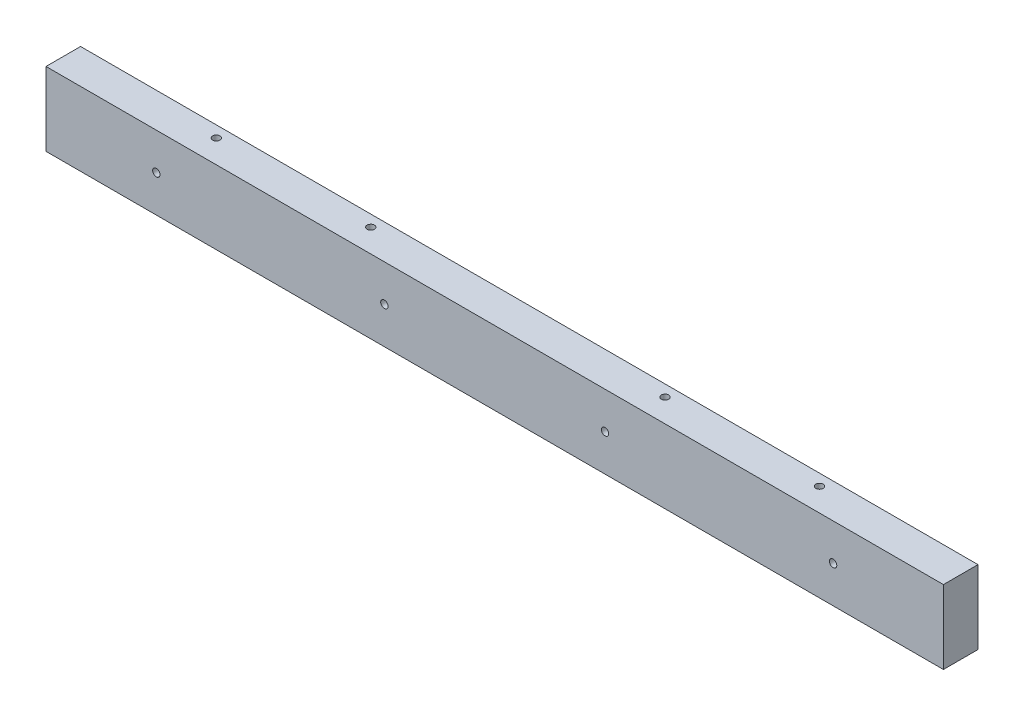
from build123d import *

# Parameters (mm, degrees)
SKETCH1_W           = 1220
SKETCH1_H           = 47
BOSS_EXTRUDE1_DEPTH = 100
CUT_EXTRUDE1_REACH  = 1226.993
SKETCH2_R           = 5
CUT_EXTRUDE2_REACH  = 1226.993
SKETCH3_R           = 5


with BuildPart() as part:
    # Sketch1 → Boss-Extrude1 (new body)
    with BuildSketch(Plane(origin=(0, 0, 0), x_dir=(1, 0, 0), z_dir=(0, 1, 0))):
        with Locations((610, 23.5)):
            Rectangle(SKETCH1_W, SKETCH1_H)
    extrude(amount=BOSS_EXTRUDE1_DEPTH)

    # Sketch2 → Cut-Extrude1 (cut, up to next)
    with BuildSketch(Plane.XY, mode=Mode.PRIVATE) as cut_extrude1_sk1:
        with Locations((150, 50)):
            Circle(SKETCH2_R)
    cut_extrude1_tool1 = extrude(cut_extrude1_sk1.sketch, amount=-CUT_EXTRUDE1_REACH, mode=Mode.PRIVATE) & part.part
    # Sketch2 → Cut-Extrude1 (cut, up to next)
    with BuildSketch(Plane.XY, mode=Mode.PRIVATE) as cut_extrude1_sk2:
        with Locations((460, 50)):
            Circle(SKETCH2_R)
    cut_extrude1_tool2 = extrude(cut_extrude1_sk2.sketch, amount=-CUT_EXTRUDE1_REACH, mode=Mode.PRIVATE) & part.part
    # Sketch2 → Cut-Extrude1 (cut, up to next)
    with BuildSketch(Plane.XY, mode=Mode.PRIVATE) as cut_extrude1_sk3:
        with Locations((760, 50)):
            Circle(SKETCH2_R)
    cut_extrude1_tool3 = extrude(cut_extrude1_sk3.sketch, amount=-CUT_EXTRUDE1_REACH, mode=Mode.PRIVATE) & part.part
    # Sketch2 → Cut-Extrude1 (cut, up to next)
    with BuildSketch(Plane.XY, mode=Mode.PRIVATE) as cut_extrude1_sk4:
        with Locations((1070, 50)):
            Circle(SKETCH2_R)
    cut_extrude1_tool4 = extrude(cut_extrude1_sk4.sketch, amount=-CUT_EXTRUDE1_REACH, mode=Mode.PRIVATE) & part.part
    add(cut_extrude1_tool1.solids().sort_by_distance((150, 50, 0))[0], mode=Mode.SUBTRACT)
    add(cut_extrude1_tool2.solids().sort_by_distance((460, 50, 0))[0], mode=Mode.SUBTRACT)
    add(cut_extrude1_tool3.solids().sort_by_distance((760, 50, 0))[0], mode=Mode.SUBTRACT)
    add(cut_extrude1_tool4.solids().sort_by_distance((1070, 50, 0))[0], mode=Mode.SUBTRACT)

    # Sketch3 → Cut-Extrude2 (cut, up to next)
    with BuildSketch(Plane(origin=(0, 100, 0), x_dir=(1, 0, 0), z_dir=(0, 1, 0)), mode=Mode.PRIVATE) as cut_extrude2_sk1:
        with Locations(Location((1020, 31.5, 0), (0, 0, 270))):
            Circle(SKETCH3_R)
    cut_extrude2_tool1 = extrude(cut_extrude2_sk1.sketch, amount=-CUT_EXTRUDE2_REACH, mode=Mode.PRIVATE) & part.part
    # Sketch3 → Cut-Extrude2 (cut, up to next)
    with BuildSketch(Plane(origin=(0, 100, 0), x_dir=(1, 0, 0), z_dir=(0, 1, 0)), mode=Mode.PRIVATE) as cut_extrude2_sk2:
        with Locations(Location((810, 31.5, 0), (0, 0, 270))):
            Circle(SKETCH3_R)
    cut_extrude2_tool2 = extrude(cut_extrude2_sk2.sketch, amount=-CUT_EXTRUDE2_REACH, mode=Mode.PRIVATE) & part.part
    # Sketch3 → Cut-Extrude2 (cut, up to next)
    with BuildSketch(Plane(origin=(0, 100, 0), x_dir=(1, 0, 0), z_dir=(0, 1, 0)), mode=Mode.PRIVATE) as cut_extrude2_sk3:
        with Locations(Location((410, 31.5, 0), (0, 0, 270))):
            Circle(SKETCH3_R)
    cut_extrude2_tool3 = extrude(cut_extrude2_sk3.sketch, amount=-CUT_EXTRUDE2_REACH, mode=Mode.PRIVATE) & part.part
    # Sketch3 → Cut-Extrude2 (cut, up to next)
    with BuildSketch(Plane(origin=(0, 100, 0), x_dir=(1, 0, 0), z_dir=(0, 1, 0)), mode=Mode.PRIVATE) as cut_extrude2_sk4:
        with Locations(Location((200, 31.5, 0), (0, 0, 270))):
            Circle(SKETCH3_R)
    cut_extrude2_tool4 = extrude(cut_extrude2_sk4.sketch, amount=-CUT_EXTRUDE2_REACH, mode=Mode.PRIVATE) & part.part
    add(cut_extrude2_tool1.solids().sort_by_distance((1020, 100, -31.5))[0], mode=Mode.SUBTRACT)
    add(cut_extrude2_tool2.solids().sort_by_distance((810, 100, -31.5))[0], mode=Mode.SUBTRACT)
    add(cut_extrude2_tool3.solids().sort_by_distance((410, 100, -31.5))[0], mode=Mode.SUBTRACT)
    add(cut_extrude2_tool4.solids().sort_by_distance((200, 100, -31.5))[0], mode=Mode.SUBTRACT)


solid = part.part
